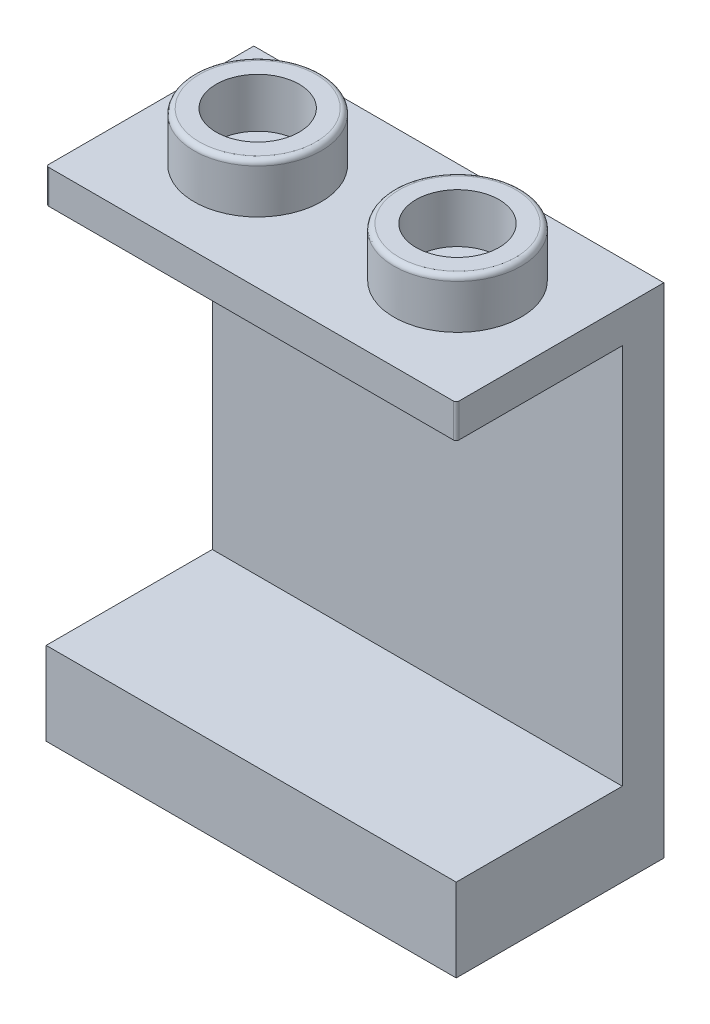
from build123d import *

# Parameters (mm, degrees)
SKIZZE1_W                       = 15.8
SKIZZE1_H                       = 19.2
LINEAR_AUSTRAGEN1_DEPTH         = 8
SKIZZE2_W                       = 15.8
SKIZZE2_H                       = 14.7
SCHNITT_LINEAR_AUSTRAGEN1_DEPTH = 6.4
SKIZZE3_R                       = 2.45
SKIZZE3_R_2                     = 1.6
LINEAR_AUSTRAGEN2_DEPTH         = 1.9
VERRUNDUNG1_R                   = 0.2
SKIZZE4_W                       = 12.6
SKIZZE4_H                       = 4.8
SCHNITT_LINEAR_AUSTRAGEN2_DEPTH = 2.1
VERRUNDUNG2_R                   = 0.1
VERRUNDUNG3_R                   = 0.1
SKIZZE5_R                       = 1.55
SKIZZE5_R_2                     = 0.75
LINEAR_AUSTRAGEN3_DEPTH         = 2
VERRUNDUNG4_R                   = 0.1


with BuildPart() as part:
    # Skizze1 → Linear austragen1 (new body)
    with BuildSketch(Plane.XY):
        with Locations((7.9, 9.6)):
            Rectangle(SKIZZE1_W, SKIZZE1_H)
    extrude(amount=LINEAR_AUSTRAGEN1_DEPTH)

    # Skizze2 → Schnitt-Linear austragen1 (cut)
    with BuildSketch(Plane.XY.offset(8)):
        with Locations((7.9, 10.55)):
            Rectangle(SKIZZE2_W, SKIZZE2_H)
    extrude(amount=-SCHNITT_LINEAR_AUSTRAGEN1_DEPTH, mode=Mode.SUBTRACT)

    # Skizze3 → Linear austragen2 (add)
    # profile 1 of 2: a face of its own
    with BuildSketch(Plane(origin=(0, 19.2, 0), x_dir=(-1, 0, 0), z_dir=(0, 1, 0))):
        with Locations(Location((-4.05, 3.9, 0), (0, 0, 270))):
            Circle(SKIZZE3_R)
        with Locations(Location((-4.05, 3.9, 0), (0, 0, 270))):
            Circle(SKIZZE3_R_2, mode=Mode.SUBTRACT)
    # profile 2 of 2: a face of its own
    with BuildSketch(Plane(origin=(0, 19.2, 0), x_dir=(-1, 0, 0), z_dir=(0, 1, 0))):
        with Locations(Location((-11.75, 3.9, 0), (0, 0, 270))):
            Circle(SKIZZE3_R)
        with Locations(Location((-11.75, 3.9, 0), (0, 0, 270))):
            Circle(SKIZZE3_R_2, mode=Mode.SUBTRACT)
    extrude(amount=LINEAR_AUSTRAGEN2_DEPTH)

    # Verrundung1
    verrundung1_edges = [part.edges().sort_by_distance(p)[0] for p in [
        (4.05, 21.1, 6.35),
        (11.75, 21.1, 6.35),
    ]]
    fillet(verrundung1_edges, radius=VERRUNDUNG1_R)

    # Skizze4 → Schnitt-Linear austragen2 (cut)
    with BuildSketch(Plane.XZ):
        with Locations((7.9, 4)):
            Rectangle(SKIZZE4_W, SKIZZE4_H)
    extrude(amount=-SCHNITT_LINEAR_AUSTRAGEN2_DEPTH, mode=Mode.SUBTRACT)

    # Verrundung2
    verrundung2_edges = [part.edges().sort_by_distance(p)[0] for p in [
        (15.8, 18.55, 8),
    ]]
    fillet(verrundung2_edges, radius=VERRUNDUNG2_R)

    # Verrundung3
    verrundung3_edges = [part.edges().sort_by_distance(p)[0] for p in [
        (0, 18.55, 8),
    ]]
    fillet(verrundung3_edges, radius=VERRUNDUNG3_R)

    # Skizze5 → Linear austragen3 (add)
    with BuildSketch(Plane.XZ.offset(-2.1)):
        with Locations(Location((7.8, 4, 0), (0, 0, 90))):
            Circle(SKIZZE5_R)
        with Locations(Location((7.8, 4, 0), (0, 0, 270))):
            Circle(SKIZZE5_R_2, mode=Mode.SUBTRACT)
    extrude(amount=LINEAR_AUSTRAGEN3_DEPTH)

    # Verrundung4
    verrundung4_edges = [part.edges().sort_by_distance(p)[0] for p in [
        (7.8, 0.1, 4.75),
    ]]
    fillet(verrundung4_edges, radius=VERRUNDUNG4_R)


solid = part.part
